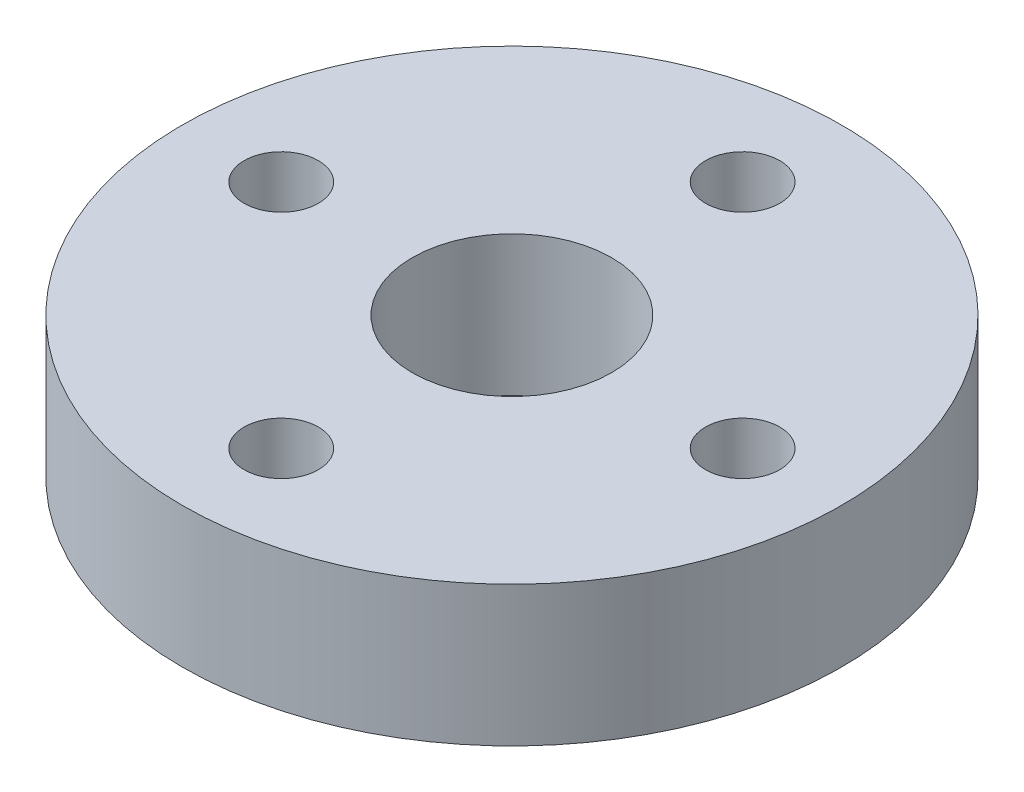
ISO-10303-21;
HEADER;
FILE_DESCRIPTION(('STEP AP214'),'2;1');
FILE_NAME('part.step','',(''),(''),'','','');
FILE_SCHEMA(('AUTOMOTIVE_DESIGN { 1 0 10303 214 1 1 1 1 }'));
ENDSEC;
DATA;
#1=APPLICATION_CONTEXT('core data for automotive mechanical design processes');
#2=APPLICATION_PROTOCOL_DEFINITION('international standard','automotive_design',2000,#1);
#3=PRODUCT_CONTEXT('',#1,'mechanical');
#4=PRODUCT('Part','Part','',(#3));
#5=PRODUCT_RELATED_PRODUCT_CATEGORY('part','',(#4));
#6=PRODUCT_DEFINITION_FORMATION('','',#4);
#7=PRODUCT_DEFINITION_CONTEXT('part definition',#1,'design');
#8=PRODUCT_DEFINITION('design','',#6,#7);
#9=PRODUCT_DEFINITION_SHAPE('','',#8);
#10=(LENGTH_UNIT() NAMED_UNIT(*) SI_UNIT(.MILLI.,.METRE.));
#11=(NAMED_UNIT(*) PLANE_ANGLE_UNIT() SI_UNIT($,.RADIAN.));
#12=(NAMED_UNIT(*) SI_UNIT($,.STERADIAN.) SOLID_ANGLE_UNIT());
#13=UNCERTAINTY_MEASURE_WITH_UNIT(LENGTH_MEASURE(1.E-05),#10,'distance_accuracy_value','');
#14=(GEOMETRIC_REPRESENTATION_CONTEXT(3) GLOBAL_UNCERTAINTY_ASSIGNED_CONTEXT((#13)) GLOBAL_UNIT_ASSIGNED_CONTEXT((#10,
#11,#12)) REPRESENTATION_CONTEXT('',''));
#15=CARTESIAN_POINT('',(0.,0.,0.));
#16=DIRECTION('',(0.,0.,1.));
#17=DIRECTION('',(1.,0.,0.));
#18=AXIS2_PLACEMENT_3D('',#15,#16,#17);
#19=CARTESIAN_POINT('',(0.,0.,0.));
#20=DIRECTION('',(0.,1.,0.));
#21=DIRECTION('',(0.,0.,1.));
#22=AXIS2_PLACEMENT_3D('',#19,#20,#21);
#23=PLANE('',#22);
#24=CARTESIAN_POINT('',(0.,0.,-7.));
#25=DIRECTION('',(0.,-1.,0.));
#26=DIRECTION('',(0.,0.,-1.));
#27=AXIS2_PLACEMENT_3D('',#24,#25,#26);
#28=CIRCLE('',#27,1.125);
#29=CARTESIAN_POINT('',(0.,0.,-8.125));
#30=VERTEX_POINT('',#29);
#31=EDGE_CURVE('E209',#30,#30,#28,.T.);
#32=ORIENTED_EDGE('',*,*,#31,.F.);
#33=EDGE_LOOP('',(#32));
#34=FACE_BOUND('',#33,.T.);
#35=CARTESIAN_POINT('',(7.,0.,0.));
#36=DIRECTION('',(0.,-1.,0.));
#37=DIRECTION('',(0.,0.,-1.));
#38=AXIS2_PLACEMENT_3D('',#35,#36,#37);
#39=CIRCLE('',#38,1.125);
#40=CARTESIAN_POINT('',(7.,0.,-1.125));
#41=VERTEX_POINT('',#40);
#42=EDGE_CURVE('E205',#41,#41,#39,.T.);
#43=ORIENTED_EDGE('',*,*,#42,.F.);
#44=EDGE_LOOP('',(#43));
#45=FACE_BOUND('',#44,.T.);
#46=CARTESIAN_POINT('',(-7.,0.,0.));
#47=DIRECTION('',(0.,-1.,0.));
#48=DIRECTION('',(0.,0.,-1.));
#49=AXIS2_PLACEMENT_3D('',#46,#47,#48);
#50=CIRCLE('',#49,1.125);
#51=CARTESIAN_POINT('',(-7.,0.,-1.125));
#52=VERTEX_POINT('',#51);
#53=EDGE_CURVE('E213',#52,#52,#50,.T.);
#54=ORIENTED_EDGE('',*,*,#53,.F.);
#55=EDGE_LOOP('',(#54));
#56=FACE_BOUND('',#55,.T.);
#57=CARTESIAN_POINT('',(0.,0.,7.));
#58=DIRECTION('',(0.,-1.,0.));
#59=DIRECTION('',(0.,0.,-1.));
#60=AXIS2_PLACEMENT_3D('',#57,#58,#59);
#61=CIRCLE('',#60,1.125);
#62=CARTESIAN_POINT('',(0.,0.,5.875));
#63=VERTEX_POINT('',#62);
#64=EDGE_CURVE('E217',#63,#63,#61,.T.);
#65=ORIENTED_EDGE('',*,*,#64,.F.);
#66=EDGE_LOOP('',(#65));
#67=FACE_BOUND('',#66,.T.);
#68=CARTESIAN_POINT('',(0.,0.,0.));
#69=DIRECTION('',(0.,1.,0.));
#70=DIRECTION('',(0.,0.,1.));
#71=AXIS2_PLACEMENT_3D('',#68,#69,#70);
#72=CIRCLE('',#71,10.);
#73=CARTESIAN_POINT('',(0.,0.,10.));
#74=VERTEX_POINT('',#73);
#75=EDGE_CURVE('E47',#74,#74,#72,.T.);
#76=ORIENTED_EDGE('',*,*,#75,.F.);
#77=EDGE_LOOP('',(#76));
#78=FACE_BOUND('',#77,.T.);
#79=CARTESIAN_POINT('',(-7.,0.,0.));
#80=DIRECTION('',(0.,1.,0.));
#81=DIRECTION('',(0.,0.,1.));
#82=AXIS2_PLACEMENT_3D('',#79,#80,#81);
#83=CIRCLE('',#82,2.125);
#84=CARTESIAN_POINT('',(-8.96316964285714,0.,-0.813381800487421));
#85=VERTEX_POINT('',#84);
#86=CARTESIAN_POINT('',(-8.96316964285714,0.,0.813381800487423));
#87=VERTEX_POINT('',#86);
#88=EDGE_CURVE('E176',#85,#87,#83,.F.);
#89=ORIENTED_EDGE('',*,*,#88,.T.);
#90=CARTESIAN_POINT('',(0.,0.,0.));
#91=DIRECTION('',(0.,1.,0.));
#92=DIRECTION('',(0.,0.,1.));
#93=AXIS2_PLACEMENT_3D('',#90,#91,#92);
#94=CIRCLE('',#93,9.);
#95=CARTESIAN_POINT('',(-0.813381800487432,0.,8.96316964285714));
#96=VERTEX_POINT('',#95);
#97=EDGE_CURVE('E152',#87,#96,#94,.T.);
#98=ORIENTED_EDGE('',*,*,#97,.T.);
#99=CARTESIAN_POINT('',(0.,0.,7.));
#100=DIRECTION('',(0.,1.,0.));
#101=DIRECTION('',(0.,0.,1.));
#102=AXIS2_PLACEMENT_3D('',#99,#100,#101);
#103=CIRCLE('',#102,2.125);
#104=CARTESIAN_POINT('',(0.813381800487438,0.,8.96316964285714));
#105=VERTEX_POINT('',#104);
#106=EDGE_CURVE('E179',#96,#105,#103,.F.);
#107=ORIENTED_EDGE('',*,*,#106,.T.);
#108=CARTESIAN_POINT('',(8.96316964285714,0.,0.813381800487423));
#109=VERTEX_POINT('',#108);
#110=EDGE_CURVE('E59',#105,#109,#94,.T.);
#111=ORIENTED_EDGE('',*,*,#110,.T.);
#112=CARTESIAN_POINT('',(7.,0.,0.));
#113=DIRECTION('',(0.,1.,0.));
#114=DIRECTION('',(0.,0.,1.));
#115=AXIS2_PLACEMENT_3D('',#112,#113,#114);
#116=CIRCLE('',#115,2.125);
#117=CARTESIAN_POINT('',(8.96316964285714,0.,-0.813381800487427));
#118=VERTEX_POINT('',#117);
#119=EDGE_CURVE('E181',#109,#118,#116,.F.);
#120=ORIENTED_EDGE('',*,*,#119,.T.);
#121=CARTESIAN_POINT('',(0.813381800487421,0.,-8.96316964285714));
#122=VERTEX_POINT('',#121);
#123=EDGE_CURVE('E156',#118,#122,#94,.T.);
#124=ORIENTED_EDGE('',*,*,#123,.T.);
#125=CARTESIAN_POINT('',(0.,0.,-7.));
#126=DIRECTION('',(0.,1.,0.));
#127=DIRECTION('',(0.,0.,1.));
#128=AXIS2_PLACEMENT_3D('',#125,#126,#127);
#129=CIRCLE('',#128,2.125);
#130=CARTESIAN_POINT('',(-0.813381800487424,0.,-8.96316964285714));
#131=VERTEX_POINT('',#130);
#132=EDGE_CURVE('E180',#122,#131,#129,.F.);
#133=ORIENTED_EDGE('',*,*,#132,.T.);
#134=EDGE_CURVE('E116',#131,#85,#94,.T.);
#135=ORIENTED_EDGE('',*,*,#134,.T.);
#136=EDGE_LOOP('',(#89,#98,#107,#111,#120,#124,#133,#135));
#137=FACE_BOUND('',#136,.T.);
#138=ADVANCED_FACE('F43',(#34,#45,#56,#67,#78,#137),#23,.F.);
#139=CARTESIAN_POINT('',(0.,4.25,0.));
#140=DIRECTION('',(0.,1.,0.));
#141=DIRECTION('',(0.,0.,1.));
#142=AXIS2_PLACEMENT_3D('',#139,#140,#141);
#143=PLANE('',#142);
#144=CARTESIAN_POINT('',(0.,4.25,-7.));
#145=DIRECTION('',(0.,-1.,0.));
#146=DIRECTION('',(0.,0.,-1.));
#147=AXIS2_PLACEMENT_3D('',#144,#145,#146);
#148=CIRCLE('',#147,1.125);
#149=CARTESIAN_POINT('',(0.,4.25,-8.125));
#150=VERTEX_POINT('',#149);
#151=EDGE_CURVE('E222',#150,#150,#148,.T.);
#152=ORIENTED_EDGE('',*,*,#151,.T.);
#153=EDGE_LOOP('',(#152));
#154=FACE_BOUND('',#153,.T.);
#155=CARTESIAN_POINT('',(0.,4.25,7.));
#156=DIRECTION('',(0.,-1.,0.));
#157=DIRECTION('',(0.,0.,-1.));
#158=AXIS2_PLACEMENT_3D('',#155,#156,#157);
#159=CIRCLE('',#158,1.125);
#160=CARTESIAN_POINT('',(0.,4.25,5.875));
#161=VERTEX_POINT('',#160);
#162=EDGE_CURVE('E227',#161,#161,#159,.T.);
#163=ORIENTED_EDGE('',*,*,#162,.T.);
#164=EDGE_LOOP('',(#163));
#165=FACE_BOUND('',#164,.T.);
#166=CARTESIAN_POINT('',(7.,4.25,0.));
#167=DIRECTION('',(0.,-1.,0.));
#168=DIRECTION('',(0.,0.,-1.));
#169=AXIS2_PLACEMENT_3D('',#166,#167,#168);
#170=CIRCLE('',#169,1.125);
#171=CARTESIAN_POINT('',(7.,4.25,-1.125));
#172=VERTEX_POINT('',#171);
#173=EDGE_CURVE('E231',#172,#172,#170,.T.);
#174=ORIENTED_EDGE('',*,*,#173,.T.);
#175=EDGE_LOOP('',(#174));
#176=FACE_BOUND('',#175,.T.);
#177=CARTESIAN_POINT('',(-7.,4.25,0.));
#178=DIRECTION('',(0.,-1.,0.));
#179=DIRECTION('',(0.,0.,-1.));
#180=AXIS2_PLACEMENT_3D('',#177,#178,#179);
#181=CIRCLE('',#180,1.125);
#182=CARTESIAN_POINT('',(-7.,4.25,-1.125));
#183=VERTEX_POINT('',#182);
#184=EDGE_CURVE('E221',#183,#183,#181,.T.);
#185=ORIENTED_EDGE('',*,*,#184,.T.);
#186=EDGE_LOOP('',(#185));
#187=FACE_BOUND('',#186,.T.);
#188=CARTESIAN_POINT('',(0.,4.25,0.));
#189=DIRECTION('',(0.,1.,0.));
#190=DIRECTION('',(0.,0.,1.));
#191=AXIS2_PLACEMENT_3D('',#188,#189,#190);
#192=CIRCLE('',#191,10.);
#193=CARTESIAN_POINT('',(0.,4.25,10.));
#194=VERTEX_POINT('',#193);
#195=EDGE_CURVE('E11',#194,#194,#192,.T.);
#196=ORIENTED_EDGE('',*,*,#195,.T.);
#197=EDGE_LOOP('',(#196));
#198=FACE_BOUND('',#197,.T.);
#199=CARTESIAN_POINT('',(0.,4.25,0.));
#200=DIRECTION('',(0.,1.,0.));
#201=DIRECTION('',(0.,0.,1.));
#202=AXIS2_PLACEMENT_3D('',#199,#200,#201);
#203=CIRCLE('',#202,3.025);
#204=CARTESIAN_POINT('',(0.,4.25,3.025));
#205=VERTEX_POINT('',#204);
#206=EDGE_CURVE('E238',#205,#205,#203,.T.);
#207=ORIENTED_EDGE('',*,*,#206,.F.);
#208=EDGE_LOOP('',(#207));
#209=FACE_BOUND('',#208,.T.);
#210=ADVANCED_FACE('F263',(#154,#165,#176,#187,#198,#209),#143,.T.);
#211=CARTESIAN_POINT('',(0.,0.,0.));
#212=DIRECTION('',(0.,1.,0.));
#213=DIRECTION('',(0.,0.,1.));
#214=AXIS2_PLACEMENT_3D('',#211,#212,#213);
#215=CIRCLE('',#214,4.025);
#216=CARTESIAN_POINT('',(0.,0.,4.025));
#217=VERTEX_POINT('',#216);
#218=EDGE_CURVE('E128',#217,#217,#215,.T.);
#219=ORIENTED_EDGE('',*,*,#218,.F.);
#220=EDGE_LOOP('',(#219));
#221=FACE_BOUND('',#220,.T.);
#222=CARTESIAN_POINT('',(0.,0.,0.));
#223=DIRECTION('',(0.,1.,0.));
#224=DIRECTION('',(0.,0.,1.));
#225=AXIS2_PLACEMENT_3D('',#222,#223,#224);
#226=CIRCLE('',#225,3.025);
#227=CARTESIAN_POINT('',(0.,0.,3.025));
#228=VERTEX_POINT('',#227);
#229=EDGE_CURVE('E226',#228,#228,#226,.T.);
#230=ORIENTED_EDGE('',*,*,#229,.T.);
#231=EDGE_LOOP('',(#230));
#232=FACE_BOUND('',#231,.T.);
#233=ADVANCED_FACE('F246',(#221,#232),#23,.F.);
#234=CARTESIAN_POINT('',(0.,4.25,0.));
#235=DIRECTION('',(0.,-1.,0.));
#236=DIRECTION('',(0.,0.,-1.));
#237=AXIS2_PLACEMENT_3D('',#234,#235,#236);
#238=CYLINDRICAL_SURFACE('',#237,10.);
#239=ORIENTED_EDGE('',*,*,#195,.F.);
#240=EDGE_LOOP('',(#239));
#241=FACE_BOUND('',#240,.T.);
#242=ORIENTED_EDGE('',*,*,#75,.T.);
#243=EDGE_LOOP('',(#242));
#244=FACE_BOUND('',#243,.T.);
#245=ADVANCED_FACE('F45',(#241,#244),#238,.T.);
#246=CARTESIAN_POINT('',(0.,4.25,0.));
#247=DIRECTION('',(0.,-1.,0.));
#248=DIRECTION('',(0.,0.,-1.));
#249=AXIS2_PLACEMENT_3D('',#246,#247,#248);
#250=CYLINDRICAL_SURFACE('',#249,3.025);
#251=ORIENTED_EDGE('',*,*,#206,.T.);
#252=EDGE_LOOP('',(#251));
#253=FACE_BOUND('',#252,.T.);
#254=ORIENTED_EDGE('',*,*,#229,.F.);
#255=EDGE_LOOP('',(#254));
#256=FACE_BOUND('',#255,.T.);
#257=ADVANCED_FACE('F248',(#253,#256),#250,.F.);
#258=CARTESIAN_POINT('',(-7.,4.25,0.));
#259=DIRECTION('',(0.,-1.,0.));
#260=DIRECTION('',(0.,0.,-1.));
#261=AXIS2_PLACEMENT_3D('',#258,#259,#260);
#262=CYLINDRICAL_SURFACE('',#261,1.125);
#263=ORIENTED_EDGE('',*,*,#184,.F.);
#264=EDGE_LOOP('',(#263));
#265=FACE_BOUND('',#264,.T.);
#266=ORIENTED_EDGE('',*,*,#53,.T.);
#267=EDGE_LOOP('',(#266));
#268=FACE_BOUND('',#267,.T.);
#269=ADVANCED_FACE('F250',(#265,#268),#262,.F.);
#270=CARTESIAN_POINT('',(7.,4.25,0.));
#271=DIRECTION('',(0.,-1.,0.));
#272=DIRECTION('',(0.,0.,-1.));
#273=AXIS2_PLACEMENT_3D('',#270,#271,#272);
#274=CYLINDRICAL_SURFACE('',#273,1.125);
#275=ORIENTED_EDGE('',*,*,#173,.F.);
#276=EDGE_LOOP('',(#275));
#277=FACE_BOUND('',#276,.T.);
#278=ORIENTED_EDGE('',*,*,#42,.T.);
#279=EDGE_LOOP('',(#278));
#280=FACE_BOUND('',#279,.T.);
#281=ADVANCED_FACE('F257',(#277,#280),#274,.F.);
#282=CARTESIAN_POINT('',(0.,4.25,7.));
#283=DIRECTION('',(0.,-1.,0.));
#284=DIRECTION('',(0.,0.,-1.));
#285=AXIS2_PLACEMENT_3D('',#282,#283,#284);
#286=CYLINDRICAL_SURFACE('',#285,1.125);
#287=ORIENTED_EDGE('',*,*,#162,.F.);
#288=EDGE_LOOP('',(#287));
#289=FACE_BOUND('',#288,.T.);
#290=ORIENTED_EDGE('',*,*,#64,.T.);
#291=EDGE_LOOP('',(#290));
#292=FACE_BOUND('',#291,.T.);
#293=ADVANCED_FACE('F310',(#289,#292),#286,.F.);
#294=CARTESIAN_POINT('',(0.,4.25,-7.));
#295=DIRECTION('',(0.,-1.,0.));
#296=DIRECTION('',(0.,0.,-1.));
#297=AXIS2_PLACEMENT_3D('',#294,#295,#296);
#298=CYLINDRICAL_SURFACE('',#297,1.125);
#299=ORIENTED_EDGE('',*,*,#151,.F.);
#300=EDGE_LOOP('',(#299));
#301=FACE_BOUND('',#300,.T.);
#302=ORIENTED_EDGE('',*,*,#31,.T.);
#303=EDGE_LOOP('',(#302));
#304=FACE_BOUND('',#303,.T.);
#305=ADVANCED_FACE('F321',(#301,#304),#298,.F.);
#306=CARTESIAN_POINT('',(0.,4.25,0.));
#307=DIRECTION('',(0.,-1.,0.));
#308=DIRECTION('',(0.,0.,-1.));
#309=AXIS2_PLACEMENT_3D('',#306,#307,#308);
#310=CYLINDRICAL_SURFACE('',#309,9.);
#311=ORIENTED_EDGE('',*,*,#97,.F.);
#312=DIRECTION('',(0.,-1.,0.));
#313=VECTOR('',#312,1.);
#314=CARTESIAN_POINT('',(-8.96316964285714,4.25,0.813381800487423));
#315=LINE('',#314,#313);
#316=CARTESIAN_POINT('',(-8.96316964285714,3.25,0.813381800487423));
#317=VERTEX_POINT('',#316);
#318=EDGE_CURVE('E196',#87,#317,#315,.F.);
#319=ORIENTED_EDGE('',*,*,#318,.T.);
#320=CARTESIAN_POINT('',(0.,3.25,0.));
#321=DIRECTION('',(0.,1.,0.));
#322=DIRECTION('',(0.,0.,1.));
#323=AXIS2_PLACEMENT_3D('',#320,#321,#322);
#324=CIRCLE('',#323,9.);
#325=CARTESIAN_POINT('',(-0.81338180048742,3.25,8.96316964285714));
#326=VERTEX_POINT('',#325);
#327=EDGE_CURVE('E138',#317,#326,#324,.T.);
#328=ORIENTED_EDGE('',*,*,#327,.T.);
#329=DIRECTION('',(0.,-1.,0.));
#330=VECTOR('',#329,1.);
#331=CARTESIAN_POINT('',(-0.813381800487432,4.25,8.96316964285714));
#332=LINE('',#331,#330);
#333=EDGE_CURVE('E202',#96,#326,#332,.F.);
#334=ORIENTED_EDGE('',*,*,#333,.F.);
#335=EDGE_LOOP('',(#311,#319,#328,#334));
#336=FACE_BOUND('',#335,.T.);
#337=ADVANCED_FACE('F331',(#336),#310,.F.);
#338=DIRECTION('',(0.,-1.,0.));
#339=VECTOR('',#338,1.);
#340=CARTESIAN_POINT('',(0.813381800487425,4.25,8.96316964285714));
#341=LINE('',#340,#339);
#342=CARTESIAN_POINT('',(0.813381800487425,3.25,8.96316964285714));
#343=VERTEX_POINT('',#342);
#344=EDGE_CURVE('E199',#105,#343,#341,.F.);
#345=ORIENTED_EDGE('',*,*,#344,.T.);
#346=CARTESIAN_POINT('',(8.96316964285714,3.25,0.813381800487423));
#347=VERTEX_POINT('',#346);
#348=EDGE_CURVE('E140',#343,#347,#324,.T.);
#349=ORIENTED_EDGE('',*,*,#348,.T.);
#350=DIRECTION('',(0.,-1.,0.));
#351=VECTOR('',#350,1.);
#352=CARTESIAN_POINT('',(8.96316964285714,4.25,0.813381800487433));
#353=LINE('',#352,#351);
#354=EDGE_CURVE('E120',#109,#347,#353,.F.);
#355=ORIENTED_EDGE('',*,*,#354,.F.);
#356=ORIENTED_EDGE('',*,*,#110,.F.);
#357=EDGE_LOOP('',(#345,#349,#355,#356));
#358=FACE_BOUND('',#357,.T.);
#359=ADVANCED_FACE('F354',(#358),#310,.F.);
#360=DIRECTION('',(0.,-1.,0.));
#361=VECTOR('',#360,1.);
#362=CARTESIAN_POINT('',(8.96316964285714,4.25,-0.813381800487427));
#363=LINE('',#362,#361);
#364=CARTESIAN_POINT('',(8.96316964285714,3.25,-0.813381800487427));
#365=VERTEX_POINT('',#364);
#366=EDGE_CURVE('E190',#118,#365,#363,.F.);
#367=ORIENTED_EDGE('',*,*,#366,.T.);
#368=CARTESIAN_POINT('',(0.813381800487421,3.25,-8.96316964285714));
#369=VERTEX_POINT('',#368);
#370=EDGE_CURVE('E145',#365,#369,#324,.T.);
#371=ORIENTED_EDGE('',*,*,#370,.T.);
#372=DIRECTION('',(0.,-1.,0.));
#373=VECTOR('',#372,1.);
#374=CARTESIAN_POINT('',(0.813381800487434,4.25,-8.96316964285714));
#375=LINE('',#374,#373);
#376=EDGE_CURVE('E67',#122,#369,#375,.F.);
#377=ORIENTED_EDGE('',*,*,#376,.F.);
#378=ORIENTED_EDGE('',*,*,#123,.F.);
#379=EDGE_LOOP('',(#367,#371,#377,#378));
#380=FACE_BOUND('',#379,.T.);
#381=ADVANCED_FACE('F364',(#380),#310,.F.);
#382=CARTESIAN_POINT('',(0.,3.25,0.));
#383=DIRECTION('',(0.,1.,0.));
#384=DIRECTION('',(0.,0.,1.));
#385=AXIS2_PLACEMENT_3D('',#382,#383,#384);
#386=PLANE('',#385);
#387=CARTESIAN_POINT('',(-0.813381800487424,3.25,-8.96316964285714));
#388=VERTEX_POINT('',#387);
#389=CARTESIAN_POINT('',(-8.96316964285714,3.25,-0.813381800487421));
#390=VERTEX_POINT('',#389);
#391=EDGE_CURVE('E114',#388,#390,#324,.T.);
#392=ORIENTED_EDGE('',*,*,#391,.F.);
#393=CARTESIAN_POINT('',(0.,3.25,-7.));
#394=DIRECTION('',(0.,1.,0.));
#395=DIRECTION('',(0.,0.,1.));
#396=AXIS2_PLACEMENT_3D('',#393,#394,#395);
#397=CIRCLE('',#396,2.125);
#398=EDGE_CURVE('E123',#369,#388,#397,.F.);
#399=ORIENTED_EDGE('',*,*,#398,.F.);
#400=ORIENTED_EDGE('',*,*,#370,.F.);
#401=CARTESIAN_POINT('',(7.,3.25,0.));
#402=DIRECTION('',(0.,1.,0.));
#403=DIRECTION('',(0.,0.,1.));
#404=AXIS2_PLACEMENT_3D('',#401,#402,#403);
#405=CIRCLE('',#404,2.125);
#406=EDGE_CURVE('E472',#347,#365,#405,.F.);
#407=ORIENTED_EDGE('',*,*,#406,.F.);
#408=ORIENTED_EDGE('',*,*,#348,.F.);
#409=CARTESIAN_POINT('',(0.,3.25,7.));
#410=DIRECTION('',(0.,1.,0.));
#411=DIRECTION('',(0.,0.,1.));
#412=AXIS2_PLACEMENT_3D('',#409,#410,#411);
#413=CIRCLE('',#412,2.125);
#414=EDGE_CURVE('E129',#326,#343,#413,.F.);
#415=ORIENTED_EDGE('',*,*,#414,.F.);
#416=ORIENTED_EDGE('',*,*,#327,.F.);
#417=CARTESIAN_POINT('',(-7.,3.25,0.));
#418=DIRECTION('',(0.,1.,0.));
#419=DIRECTION('',(0.,0.,1.));
#420=AXIS2_PLACEMENT_3D('',#417,#418,#419);
#421=CIRCLE('',#420,2.125);
#422=EDGE_CURVE('E136',#390,#317,#421,.F.);
#423=ORIENTED_EDGE('',*,*,#422,.F.);
#424=EDGE_LOOP('',(#392,#399,#400,#407,#408,#415,#416,#423));
#425=FACE_BOUND('',#424,.T.);
#426=CARTESIAN_POINT('',(0.,3.25,0.));
#427=DIRECTION('',(0.,1.,0.));
#428=DIRECTION('',(0.,0.,1.));
#429=AXIS2_PLACEMENT_3D('',#426,#427,#428);
#430=CIRCLE('',#429,4.025);
#431=CARTESIAN_POINT('',(0.,3.25,4.025));
#432=VERTEX_POINT('',#431);
#433=EDGE_CURVE('E167',#432,#432,#430,.T.);
#434=ORIENTED_EDGE('',*,*,#433,.T.);
#435=EDGE_LOOP('',(#434));
#436=FACE_BOUND('',#435,.T.);
#437=ADVANCED_FACE('F132',(#425,#436),#386,.F.);
#438=ORIENTED_EDGE('',*,*,#134,.F.);
#439=DIRECTION('',(0.,-1.,0.));
#440=VECTOR('',#439,1.);
#441=CARTESIAN_POINT('',(-0.813381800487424,4.25,-8.96316964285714));
#442=LINE('',#441,#440);
#443=EDGE_CURVE('E110',#131,#388,#442,.F.);
#444=ORIENTED_EDGE('',*,*,#443,.T.);
#445=ORIENTED_EDGE('',*,*,#391,.T.);
#446=DIRECTION('',(0.,-1.,0.));
#447=VECTOR('',#446,1.);
#448=CARTESIAN_POINT('',(-8.96316964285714,4.25,-0.813381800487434));
#449=LINE('',#448,#447);
#450=EDGE_CURVE('E193',#85,#390,#449,.F.);
#451=ORIENTED_EDGE('',*,*,#450,.F.);
#452=EDGE_LOOP('',(#438,#444,#445,#451));
#453=FACE_BOUND('',#452,.T.);
#454=ADVANCED_FACE('F112',(#453),#310,.F.);
#455=CARTESIAN_POINT('',(0.,4.25,0.));
#456=DIRECTION('',(0.,-1.,0.));
#457=DIRECTION('',(0.,0.,-1.));
#458=AXIS2_PLACEMENT_3D('',#455,#456,#457);
#459=CYLINDRICAL_SURFACE('',#458,4.025);
#460=ORIENTED_EDGE('',*,*,#433,.F.);
#461=EDGE_LOOP('',(#460));
#462=FACE_BOUND('',#461,.T.);
#463=ORIENTED_EDGE('',*,*,#218,.T.);
#464=EDGE_LOOP('',(#463));
#465=FACE_BOUND('',#464,.T.);
#466=ADVANCED_FACE('F386',(#462,#465),#459,.T.);
#467=CARTESIAN_POINT('',(-7.,4.25,0.));
#468=DIRECTION('',(0.,-1.,0.));
#469=DIRECTION('',(0.,0.,-1.));
#470=AXIS2_PLACEMENT_3D('',#467,#468,#469);
#471=CYLINDRICAL_SURFACE('',#470,2.125);
#472=ORIENTED_EDGE('',*,*,#88,.F.);
#473=ORIENTED_EDGE('',*,*,#450,.T.);
#474=ORIENTED_EDGE('',*,*,#422,.T.);
#475=ORIENTED_EDGE('',*,*,#318,.F.);
#476=EDGE_LOOP('',(#472,#473,#474,#475));
#477=FACE_BOUND('',#476,.T.);
#478=ADVANCED_FACE('F393',(#477),#471,.T.);
#479=CARTESIAN_POINT('',(7.,4.25,0.));
#480=DIRECTION('',(0.,-1.,0.));
#481=DIRECTION('',(0.,0.,-1.));
#482=AXIS2_PLACEMENT_3D('',#479,#480,#481);
#483=CYLINDRICAL_SURFACE('',#482,2.125);
#484=ORIENTED_EDGE('',*,*,#119,.F.);
#485=ORIENTED_EDGE('',*,*,#354,.T.);
#486=ORIENTED_EDGE('',*,*,#406,.T.);
#487=ORIENTED_EDGE('',*,*,#366,.F.);
#488=EDGE_LOOP('',(#484,#485,#486,#487));
#489=FACE_BOUND('',#488,.T.);
#490=ADVANCED_FACE('F403',(#489),#483,.T.);
#491=CARTESIAN_POINT('',(0.,4.25,7.));
#492=DIRECTION('',(0.,-1.,0.));
#493=DIRECTION('',(0.,0.,-1.));
#494=AXIS2_PLACEMENT_3D('',#491,#492,#493);
#495=CYLINDRICAL_SURFACE('',#494,2.125);
#496=ORIENTED_EDGE('',*,*,#333,.T.);
#497=ORIENTED_EDGE('',*,*,#414,.T.);
#498=ORIENTED_EDGE('',*,*,#344,.F.);
#499=ORIENTED_EDGE('',*,*,#106,.F.);
#500=EDGE_LOOP('',(#496,#497,#498,#499));
#501=FACE_BOUND('',#500,.T.);
#502=ADVANCED_FACE('F413',(#501),#495,.T.);
#503=CARTESIAN_POINT('',(0.,4.25,-7.));
#504=DIRECTION('',(0.,-1.,0.));
#505=DIRECTION('',(0.,0.,-1.));
#506=AXIS2_PLACEMENT_3D('',#503,#504,#505);
#507=CYLINDRICAL_SURFACE('',#506,2.125);
#508=ORIENTED_EDGE('',*,*,#132,.F.);
#509=ORIENTED_EDGE('',*,*,#376,.T.);
#510=ORIENTED_EDGE('',*,*,#398,.T.);
#511=ORIENTED_EDGE('',*,*,#443,.F.);
#512=EDGE_LOOP('',(#508,#509,#510,#511));
#513=FACE_BOUND('',#512,.T.);
#514=ADVANCED_FACE('F124',(#513),#507,.T.);
#515=CLOSED_SHELL('',(#138,#210,#233,#245,#257,#269,#281,#293,#305,#337,#359,#381,#437,#454,
#466,#478,#490,#502,#514));
#516=MANIFOLD_SOLID_BREP('B2',#515);
#517=ADVANCED_BREP_SHAPE_REPRESENTATION('',(#18,#516),#14);
#518=SHAPE_DEFINITION_REPRESENTATION(#9,#517);
ENDSEC;
END-ISO-10303-21;
